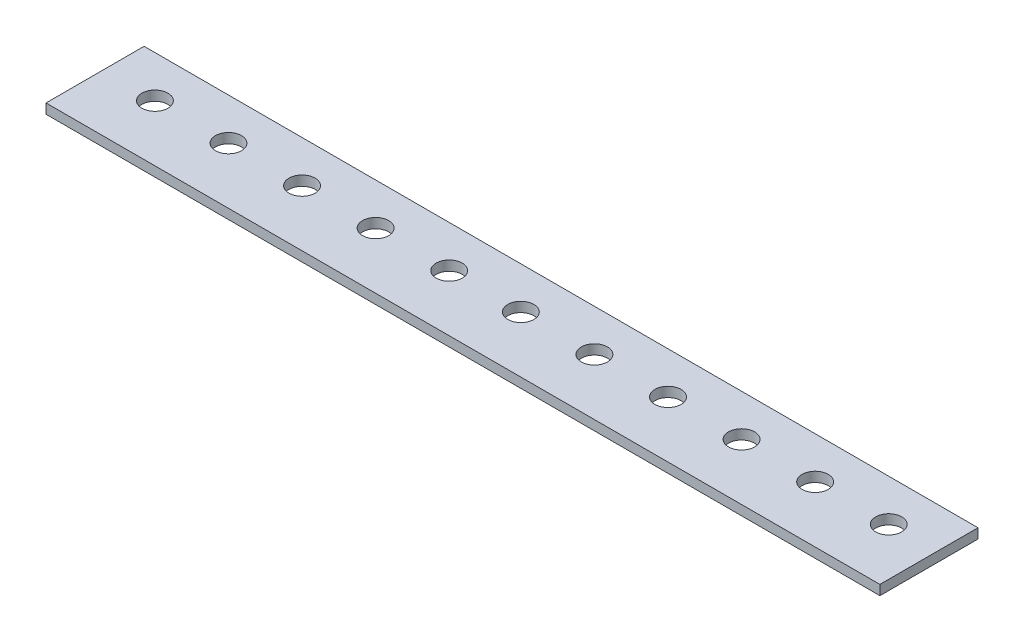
from build123d import *

# Parameters (mm, degrees)
SKETCH1_W           = 228.6
SKETCH1_H           = 38.1
SKETCH1_R           = 3.3782
BOSS_EXTRUDE1_DEPTH = 2.54
CUT_EXTRUDE1_DEPTH  = 2.54


with BuildPart() as part:
    # Sketch1 → Boss-Extrude1 (new body)
    with BuildSketch(Plane(origin=(0, 0, 0), x_dir=(1, 0, 0), z_dir=(0, 1, 0))):
        with Locations((-368.242285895, -142.875)):
            Rectangle(SKETCH1_W, SKETCH1_H)
        with Locations(Location((-361.511285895, -134.62, 0), (0, 0, 270))):
            Circle(SKETCH1_R, mode=Mode.SUBTRACT)
        with Locations(Location((-456.253285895, -134.62, 0), (0, 0, 270))):
            Circle(SKETCH1_R, mode=Mode.SUBTRACT)
        with Locations(Location((-437.203285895, -134.62, 0), (0, 0, 270))):
            Circle(SKETCH1_R, mode=Mode.SUBTRACT)
        with Locations(Location((-418.153285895, -134.62, 0), (0, 0, 270))):
            Circle(SKETCH1_R, mode=Mode.SUBTRACT)
        with Locations(Location((-399.103285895, -134.62, 0), (0, 0, 270))):
            Circle(SKETCH1_R, mode=Mode.SUBTRACT)
        with Locations(Location((-380.053285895, -134.62, 0), (0, 0, 270))):
            Circle(SKETCH1_R, mode=Mode.SUBTRACT)
        with Locations(Location((-342.461285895, -134.62, 0), (0, 0, 270))):
            Circle(SKETCH1_R, mode=Mode.SUBTRACT)
        with Locations(Location((-323.411285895, -134.62, 0), (0, 0, 270))):
            Circle(SKETCH1_R, mode=Mode.SUBTRACT)
        with Locations(Location((-304.361285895, -134.62, 0), (0, 0, 270))):
            Circle(SKETCH1_R, mode=Mode.SUBTRACT)
        with Locations(Location((-285.311285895, -134.62, 0), (0, 0, 270))):
            Circle(SKETCH1_R, mode=Mode.SUBTRACT)
        with Locations(Location((-266.261285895, -134.62, 0), (0, 0, 270))):
            Circle(SKETCH1_R, mode=Mode.SUBTRACT)
    extrude(amount=BOSS_EXTRUDE1_DEPTH)

    # Sketch2 → Cut-Extrude1 (cut)
    with BuildSketch(Plane(origin=(0, 2.54, 0), x_dir=(1, 0, 0), z_dir=(0, 1, 0))):
        Polygon((-469.842285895, -149.225), (-469.842285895, -123.825), (-482.542285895, -123.825), (-482.542285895, -161.925), (-253.942285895, -161.925), (-253.942285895, -149.225), align=None)
    extrude(amount=-CUT_EXTRUDE1_DEPTH, mode=Mode.SUBTRACT)


solid = part.part
